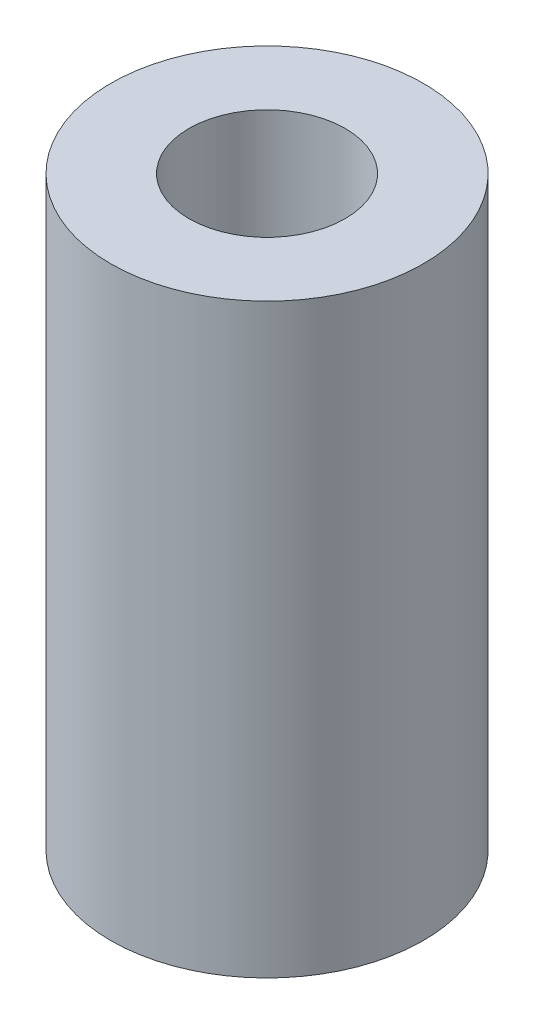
from build123d import *


with BuildPart() as part:
    # Sketch1 → Base-Revolve (revolve)
    with BuildSketch(Plane.XY, mode=Mode.PRIVATE) as base_revolve_sk:
        Polygon((2, 7), (2, 0), (1.5, 0), (1.5, -7.5), (2, -8), (4, -8), (4, 7), align=None)
    revolve(base_revolve_sk.sketch.rotate(Axis((0, 44.127367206, 0), (0, -1, 0)), 90), axis=Axis((0, 44.127367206, 0), (0, -1, 0)))


solid = part.part
